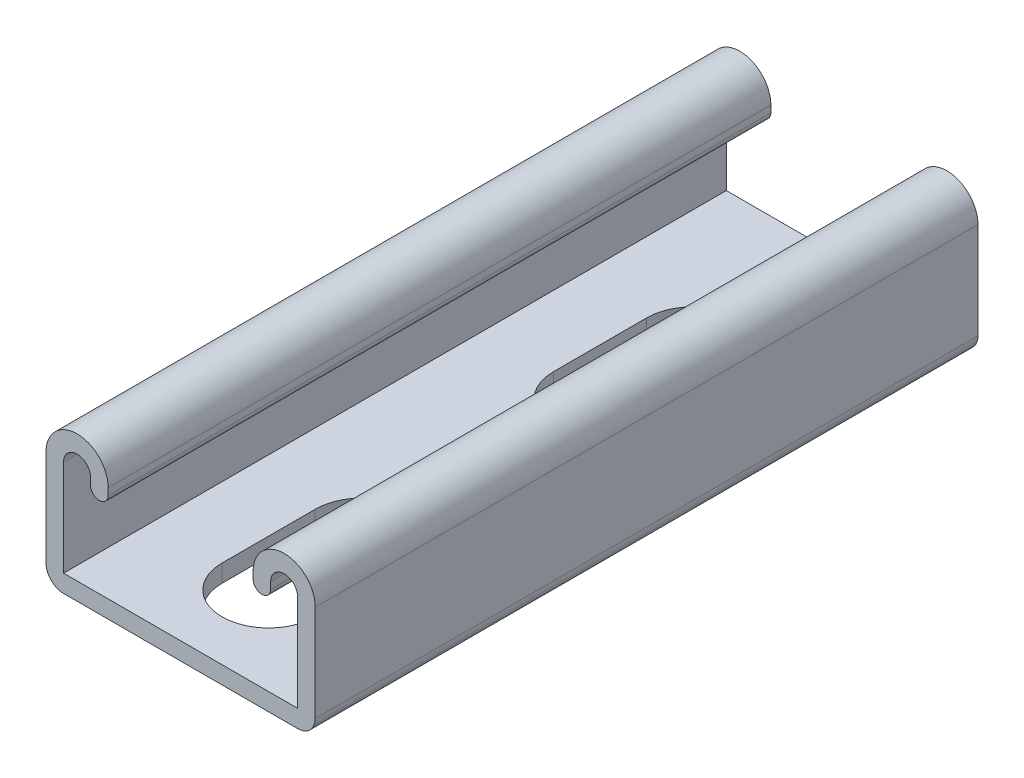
ISO-10303-21;
HEADER;
FILE_DESCRIPTION(('STEP AP214'),'2;1');
FILE_NAME('part.step','',(''),(''),'','','');
FILE_SCHEMA(('AUTOMOTIVE_DESIGN { 1 0 10303 214 1 1 1 1 }'));
ENDSEC;
DATA;
#1=APPLICATION_CONTEXT('core data for automotive mechanical design processes');
#2=APPLICATION_PROTOCOL_DEFINITION('international standard','automotive_design',2000,#1);
#3=PRODUCT_CONTEXT('',#1,'mechanical');
#4=PRODUCT('Part','Part','',(#3));
#5=PRODUCT_RELATED_PRODUCT_CATEGORY('part','',(#4));
#6=PRODUCT_DEFINITION_FORMATION('','',#4);
#7=PRODUCT_DEFINITION_CONTEXT('part definition',#1,'design');
#8=PRODUCT_DEFINITION('design','',#6,#7);
#9=PRODUCT_DEFINITION_SHAPE('','',#8);
#10=(LENGTH_UNIT() NAMED_UNIT(*) SI_UNIT(.MILLI.,.METRE.));
#11=(NAMED_UNIT(*) PLANE_ANGLE_UNIT() SI_UNIT($,.RADIAN.));
#12=(NAMED_UNIT(*) SI_UNIT($,.STERADIAN.) SOLID_ANGLE_UNIT());
#13=UNCERTAINTY_MEASURE_WITH_UNIT(LENGTH_MEASURE(1.E-05),#10,'distance_accuracy_value','');
#14=(GEOMETRIC_REPRESENTATION_CONTEXT(3) GLOBAL_UNCERTAINTY_ASSIGNED_CONTEXT((#13)) GLOBAL_UNIT_ASSIGNED_CONTEXT((#10,
#11,#12)) REPRESENTATION_CONTEXT('',''));
#15=CARTESIAN_POINT('',(0.,0.,0.));
#16=DIRECTION('',(0.,0.,1.));
#17=DIRECTION('',(1.,0.,0.));
#18=AXIS2_PLACEMENT_3D('',#15,#16,#17);
#19=CARTESIAN_POINT('',(-15.875,8.3693,101.6));
#20=DIRECTION('',(0.,0.,-1.));
#21=DIRECTION('',(-1.,0.,0.));
#22=AXIS2_PLACEMENT_3D('',#19,#20,#21);
#23=CYLINDRICAL_SURFACE('',#22,4.7625);
#24=CARTESIAN_POINT('',(-15.875,8.3693,0.));
#25=DIRECTION('',(0.,0.,1.));
#26=DIRECTION('',(-1.,0.,0.));
#27=AXIS2_PLACEMENT_3D('',#24,#25,#26);
#28=CIRCLE('',#27,4.7625);
#29=CARTESIAN_POINT('',(-11.1125,8.3693,0.));
#30=VERTEX_POINT('',#29);
#31=CARTESIAN_POINT('',(-20.6375,8.3693,0.));
#32=VERTEX_POINT('',#31);
#33=EDGE_CURVE('E254',#30,#32,#28,.T.);
#34=ORIENTED_EDGE('',*,*,#33,.T.);
#35=DIRECTION('',(0.,0.,-1.));
#36=VECTOR('',#35,1.);
#37=CARTESIAN_POINT('',(-20.6375,8.3693,101.6));
#38=LINE('',#37,#36);
#39=CARTESIAN_POINT('',(-20.6375,8.3693,101.6));
#40=VERTEX_POINT('',#39);
#41=EDGE_CURVE('E385',#40,#32,#38,.T.);
#42=ORIENTED_EDGE('',*,*,#41,.F.);
#43=CARTESIAN_POINT('',(-15.875,8.3693,101.6));
#44=DIRECTION('',(0.,0.,1.));
#45=DIRECTION('',(-1.,0.,0.));
#46=AXIS2_PLACEMENT_3D('',#43,#44,#45);
#47=CIRCLE('',#46,4.7625);
#48=CARTESIAN_POINT('',(-11.1125,8.3693,101.6));
#49=VERTEX_POINT('',#48);
#50=EDGE_CURVE('E261',#49,#40,#47,.T.);
#51=ORIENTED_EDGE('',*,*,#50,.F.);
#52=DIRECTION('',(0.,0.,-1.));
#53=VECTOR('',#52,1.);
#54=CARTESIAN_POINT('',(-11.1125,8.3693,101.6));
#55=LINE('',#54,#53);
#56=EDGE_CURVE('E299',#49,#30,#55,.T.);
#57=ORIENTED_EDGE('',*,*,#56,.T.);
#58=EDGE_LOOP('',(#34,#42,#51,#57));
#59=FACE_BOUND('',#58,.T.);
#60=ADVANCED_FACE('F33',(#59),#23,.T.);
#61=CARTESIAN_POINT('',(-20.6375,8.3693,101.6));
#62=DIRECTION('',(1.,0.,0.));
#63=DIRECTION('',(0.,1.,0.));
#64=AXIS2_PLACEMENT_3D('',#61,#62,#63);
#65=PLANE('',#64);
#66=DIRECTION('',(0.,-1.,0.));
#67=VECTOR('',#66,1.);
#68=CARTESIAN_POINT('',(-20.6375,8.3693,0.));
#69=LINE('',#68,#67);
#70=CARTESIAN_POINT('',(-20.6375,-6.4008,0.));
#71=VERTEX_POINT('',#70);
#72=EDGE_CURVE('E302',#32,#71,#69,.T.);
#73=ORIENTED_EDGE('',*,*,#72,.T.);
#74=DIRECTION('',(0.,0.,-1.));
#75=VECTOR('',#74,1.);
#76=CARTESIAN_POINT('',(-20.6375,-6.4008,101.6));
#77=LINE('',#76,#75);
#78=CARTESIAN_POINT('',(-20.6375,-6.4008,101.6));
#79=VERTEX_POINT('',#78);
#80=EDGE_CURVE('E382',#79,#71,#77,.T.);
#81=ORIENTED_EDGE('',*,*,#80,.F.);
#82=DIRECTION('',(0.,-1.,0.));
#83=VECTOR('',#82,1.);
#84=CARTESIAN_POINT('',(-20.6375,8.3693,101.6));
#85=LINE('',#84,#83);
#86=EDGE_CURVE('E264',#40,#79,#85,.T.);
#87=ORIENTED_EDGE('',*,*,#86,.F.);
#88=ORIENTED_EDGE('',*,*,#41,.T.);
#89=EDGE_LOOP('',(#73,#81,#87,#88));
#90=FACE_BOUND('',#89,.T.);
#91=ADVANCED_FACE('F426',(#90),#65,.F.);
#92=CARTESIAN_POINT('',(-17.9451,-6.4008,101.6));
#93=DIRECTION('',(0.,0.,-1.));
#94=DIRECTION('',(-1.,0.,0.));
#95=AXIS2_PLACEMENT_3D('',#92,#93,#94);
#96=CYLINDRICAL_SURFACE('',#95,2.6924);
#97=CARTESIAN_POINT('',(-17.9451,-6.4008,0.));
#98=DIRECTION('',(0.,0.,1.));
#99=DIRECTION('',(-1.,0.,0.));
#100=AXIS2_PLACEMENT_3D('',#97,#98,#99);
#101=CIRCLE('',#100,2.6924);
#102=CARTESIAN_POINT('',(-17.9451,-9.0932,0.));
#103=VERTEX_POINT('',#102);
#104=EDGE_CURVE('E304',#71,#103,#101,.T.);
#105=ORIENTED_EDGE('',*,*,#104,.T.);
#106=DIRECTION('',(0.,0.,-1.));
#107=VECTOR('',#106,1.);
#108=CARTESIAN_POINT('',(-17.9451,-9.0932,101.6));
#109=LINE('',#108,#107);
#110=CARTESIAN_POINT('',(-17.9451,-9.0932,101.6));
#111=VERTEX_POINT('',#110);
#112=EDGE_CURVE('E379',#111,#103,#109,.T.);
#113=ORIENTED_EDGE('',*,*,#112,.F.);
#114=CARTESIAN_POINT('',(-17.9451,-6.4008,101.6));
#115=DIRECTION('',(0.,0.,1.));
#116=DIRECTION('',(-1.,0.,0.));
#117=AXIS2_PLACEMENT_3D('',#114,#115,#116);
#118=CIRCLE('',#117,2.6924);
#119=EDGE_CURVE('E267',#79,#111,#118,.T.);
#120=ORIENTED_EDGE('',*,*,#119,.F.);
#121=ORIENTED_EDGE('',*,*,#80,.T.);
#122=EDGE_LOOP('',(#105,#113,#120,#121));
#123=FACE_BOUND('',#122,.T.);
#124=ADVANCED_FACE('F431',(#123),#96,.T.);
#125=CARTESIAN_POINT('',(-17.9451,-9.0932,101.6));
#126=DIRECTION('',(0.,1.,0.));
#127=DIRECTION('',(0.,0.,1.));
#128=AXIS2_PLACEMENT_3D('',#125,#126,#127);
#129=PLANE('',#128);
#130=DIRECTION('',(0.,0.,-1.));
#131=VECTOR('',#130,1.);
#132=CARTESIAN_POINT('',(-7.14375,-9.09319999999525,73.81875));
#133=LINE('',#132,#131);
#134=CARTESIAN_POINT('',(-7.14375,-9.0932,88.10625));
#135=VERTEX_POINT('',#134);
#136=CARTESIAN_POINT('',(-7.14375,-9.09319999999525,73.81875));
#137=VERTEX_POINT('',#136);
#138=EDGE_CURVE('E207',#135,#137,#133,.T.);
#139=ORIENTED_EDGE('',*,*,#138,.F.);
#140=CARTESIAN_POINT('',(0.,-9.09319999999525,88.10625));
#141=DIRECTION('',(0.,-1.,0.));
#142=DIRECTION('',(0.,0.,-1.));
#143=AXIS2_PLACEMENT_3D('',#140,#141,#142);
#144=CIRCLE('',#143,7.14375);
#145=CARTESIAN_POINT('',(7.14375,-9.09319999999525,88.10625));
#146=VERTEX_POINT('',#145);
#147=EDGE_CURVE('E47',#146,#135,#144,.T.);
#148=ORIENTED_EDGE('',*,*,#147,.F.);
#149=DIRECTION('',(0.,0.,1.));
#150=VECTOR('',#149,1.);
#151=CARTESIAN_POINT('',(7.14375,-9.09319999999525,88.10625));
#152=LINE('',#151,#150);
#153=CARTESIAN_POINT('',(7.14375,-9.09319999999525,73.81875));
#154=VERTEX_POINT('',#153);
#155=EDGE_CURVE('E223',#154,#146,#152,.T.);
#156=ORIENTED_EDGE('',*,*,#155,.F.);
#157=CARTESIAN_POINT('',(0.,-9.09319999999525,73.81875));
#158=DIRECTION('',(0.,-1.,0.));
#159=DIRECTION('',(0.,0.,-1.));
#160=AXIS2_PLACEMENT_3D('',#157,#158,#159);
#161=CIRCLE('',#160,7.14375);
#162=EDGE_CURVE('E217',#137,#154,#161,.T.);
#163=ORIENTED_EDGE('',*,*,#162,.F.);
#164=EDGE_LOOP('',(#139,#148,#156,#163));
#165=FACE_BOUND('',#164,.T.);
#166=DIRECTION('',(0.,0.,-1.));
#167=VECTOR('',#166,1.);
#168=CARTESIAN_POINT('',(-7.14375,-9.09319999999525,23.01875));
#169=LINE('',#168,#167);
#170=CARTESIAN_POINT('',(-7.14375,-9.0932,37.30625));
#171=VERTEX_POINT('',#170);
#172=CARTESIAN_POINT('',(-7.14375,-9.09319999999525,23.01875));
#173=VERTEX_POINT('',#172);
#174=EDGE_CURVE('E242',#171,#173,#169,.T.);
#175=ORIENTED_EDGE('',*,*,#174,.F.);
#176=CARTESIAN_POINT('',(0.,-9.09319999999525,37.30625));
#177=DIRECTION('',(0.,-1.,0.));
#178=DIRECTION('',(0.,0.,-1.));
#179=AXIS2_PLACEMENT_3D('',#176,#177,#178);
#180=CIRCLE('',#179,7.14375);
#181=CARTESIAN_POINT('',(7.14375,-9.09319999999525,37.30625));
#182=VERTEX_POINT('',#181);
#183=EDGE_CURVE('E240',#182,#171,#180,.T.);
#184=ORIENTED_EDGE('',*,*,#183,.F.);
#185=DIRECTION('',(0.,0.,1.));
#186=VECTOR('',#185,1.);
#187=CARTESIAN_POINT('',(7.14375,-9.09319999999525,37.30625));
#188=LINE('',#187,#186);
#189=CARTESIAN_POINT('',(7.14375,-9.09319999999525,23.01875));
#190=VERTEX_POINT('',#189);
#191=EDGE_CURVE('E248',#190,#182,#188,.T.);
#192=ORIENTED_EDGE('',*,*,#191,.F.);
#193=CARTESIAN_POINT('',(0.,-9.09319999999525,23.01875));
#194=DIRECTION('',(0.,-1.,0.));
#195=DIRECTION('',(0.,0.,-1.));
#196=AXIS2_PLACEMENT_3D('',#193,#194,#195);
#197=CIRCLE('',#196,7.14375);
#198=EDGE_CURVE('E245',#173,#190,#197,.T.);
#199=ORIENTED_EDGE('',*,*,#198,.F.);
#200=EDGE_LOOP('',(#175,#184,#192,#199));
#201=FACE_BOUND('',#200,.T.);
#202=DIRECTION('',(1.,0.,0.));
#203=VECTOR('',#202,1.);
#204=CARTESIAN_POINT('',(-17.9451,-9.0932,0.));
#205=LINE('',#204,#203);
#206=CARTESIAN_POINT('',(17.9451,-9.0932,0.));
#207=VERTEX_POINT('',#206);
#208=EDGE_CURVE('E306',#103,#207,#205,.T.);
#209=ORIENTED_EDGE('',*,*,#208,.T.);
#210=DIRECTION('',(0.,0.,-1.));
#211=VECTOR('',#210,1.);
#212=CARTESIAN_POINT('',(17.9451,-9.0932,101.6));
#213=LINE('',#212,#211);
#214=CARTESIAN_POINT('',(17.9451,-9.0932,101.6));
#215=VERTEX_POINT('',#214);
#216=EDGE_CURVE('E376',#215,#207,#213,.T.);
#217=ORIENTED_EDGE('',*,*,#216,.F.);
#218=DIRECTION('',(1.,0.,0.));
#219=VECTOR('',#218,1.);
#220=CARTESIAN_POINT('',(-17.9451,-9.0932,101.6));
#221=LINE('',#220,#219);
#222=EDGE_CURVE('E269',#111,#215,#221,.T.);
#223=ORIENTED_EDGE('',*,*,#222,.F.);
#224=ORIENTED_EDGE('',*,*,#112,.T.);
#225=EDGE_LOOP('',(#209,#217,#223,#224));
#226=FACE_BOUND('',#225,.T.);
#227=ADVANCED_FACE('F221',(#165,#201,#226),#129,.F.);
#228=CARTESIAN_POINT('',(17.9451,-6.4008,101.6));
#229=DIRECTION('',(0.,0.,-1.));
#230=DIRECTION('',(-1.,0.,0.));
#231=AXIS2_PLACEMENT_3D('',#228,#229,#230);
#232=CYLINDRICAL_SURFACE('',#231,2.6924);
#233=CARTESIAN_POINT('',(17.9451,-6.4008,0.));
#234=DIRECTION('',(0.,0.,1.));
#235=DIRECTION('',(1.,0.,0.));
#236=AXIS2_PLACEMENT_3D('',#233,#234,#235);
#237=CIRCLE('',#236,2.6924);
#238=CARTESIAN_POINT('',(20.6375,-6.4008,0.));
#239=VERTEX_POINT('',#238);
#240=EDGE_CURVE('E308',#207,#239,#237,.T.);
#241=ORIENTED_EDGE('',*,*,#240,.T.);
#242=DIRECTION('',(0.,0.,-1.));
#243=VECTOR('',#242,1.);
#244=CARTESIAN_POINT('',(20.6375,-6.4008,101.6));
#245=LINE('',#244,#243);
#246=CARTESIAN_POINT('',(20.6375,-6.4008,101.6));
#247=VERTEX_POINT('',#246);
#248=EDGE_CURVE('E373',#247,#239,#245,.T.);
#249=ORIENTED_EDGE('',*,*,#248,.F.);
#250=CARTESIAN_POINT('',(17.9451,-6.4008,101.6));
#251=DIRECTION('',(0.,0.,1.));
#252=DIRECTION('',(1.,0.,0.));
#253=AXIS2_PLACEMENT_3D('',#250,#251,#252);
#254=CIRCLE('',#253,2.6924);
#255=EDGE_CURVE('E271',#215,#247,#254,.T.);
#256=ORIENTED_EDGE('',*,*,#255,.F.);
#257=ORIENTED_EDGE('',*,*,#216,.T.);
#258=EDGE_LOOP('',(#241,#249,#256,#257));
#259=FACE_BOUND('',#258,.T.);
#260=ADVANCED_FACE('F511',(#259),#232,.T.);
#261=CARTESIAN_POINT('',(20.6375,-6.4008,101.6));
#262=DIRECTION('',(-1.,0.,0.));
#263=DIRECTION('',(0.,-1.,0.));
#264=AXIS2_PLACEMENT_3D('',#261,#262,#263);
#265=PLANE('',#264);
#266=DIRECTION('',(0.,1.,0.));
#267=VECTOR('',#266,1.);
#268=CARTESIAN_POINT('',(20.6375,-6.4008,0.));
#269=LINE('',#268,#267);
#270=CARTESIAN_POINT('',(20.6375,8.3693,0.));
#271=VERTEX_POINT('',#270);
#272=EDGE_CURVE('E310',#239,#271,#269,.T.);
#273=ORIENTED_EDGE('',*,*,#272,.T.);
#274=DIRECTION('',(0.,0.,-1.));
#275=VECTOR('',#274,1.);
#276=CARTESIAN_POINT('',(20.6375,8.3693,101.6));
#277=LINE('',#276,#275);
#278=CARTESIAN_POINT('',(20.6375,8.3693,101.6));
#279=VERTEX_POINT('',#278);
#280=EDGE_CURVE('E370',#279,#271,#277,.T.);
#281=ORIENTED_EDGE('',*,*,#280,.F.);
#282=DIRECTION('',(0.,1.,0.));
#283=VECTOR('',#282,1.);
#284=CARTESIAN_POINT('',(20.6375,-6.4008,101.6));
#285=LINE('',#284,#283);
#286=EDGE_CURVE('E273',#247,#279,#285,.T.);
#287=ORIENTED_EDGE('',*,*,#286,.F.);
#288=ORIENTED_EDGE('',*,*,#248,.T.);
#289=EDGE_LOOP('',(#273,#281,#287,#288));
#290=FACE_BOUND('',#289,.T.);
#291=ADVANCED_FACE('F507',(#290),#265,.F.);
#292=CARTESIAN_POINT('',(15.875,8.3693,101.6));
#293=DIRECTION('',(0.,0.,-1.));
#294=DIRECTION('',(-1.,0.,0.));
#295=AXIS2_PLACEMENT_3D('',#292,#293,#294);
#296=CYLINDRICAL_SURFACE('',#295,4.7625);
#297=CARTESIAN_POINT('',(15.875,8.3693,0.));
#298=DIRECTION('',(0.,0.,1.));
#299=DIRECTION('',(1.,0.,0.));
#300=AXIS2_PLACEMENT_3D('',#297,#298,#299);
#301=CIRCLE('',#300,4.7625);
#302=CARTESIAN_POINT('',(11.1125,8.3693,0.));
#303=VERTEX_POINT('',#302);
#304=EDGE_CURVE('E312',#271,#303,#301,.T.);
#305=ORIENTED_EDGE('',*,*,#304,.T.);
#306=DIRECTION('',(0.,0.,-1.));
#307=VECTOR('',#306,1.);
#308=CARTESIAN_POINT('',(11.1125,8.3693,101.6));
#309=LINE('',#308,#307);
#310=CARTESIAN_POINT('',(11.1125,8.3693,101.6));
#311=VERTEX_POINT('',#310);
#312=EDGE_CURVE('E367',#311,#303,#309,.T.);
#313=ORIENTED_EDGE('',*,*,#312,.F.);
#314=CARTESIAN_POINT('',(15.875,8.3693,101.6));
#315=DIRECTION('',(0.,0.,1.));
#316=DIRECTION('',(1.,0.,0.));
#317=AXIS2_PLACEMENT_3D('',#314,#315,#316);
#318=CIRCLE('',#317,4.7625);
#319=EDGE_CURVE('E275',#279,#311,#318,.T.);
#320=ORIENTED_EDGE('',*,*,#319,.F.);
#321=ORIENTED_EDGE('',*,*,#280,.T.);
#322=EDGE_LOOP('',(#305,#313,#320,#321));
#323=FACE_BOUND('',#322,.T.);
#324=ADVANCED_FACE('F502',(#323),#296,.T.);
#325=CARTESIAN_POINT('',(11.1125,8.3693,101.6));
#326=DIRECTION('',(1.,0.,0.));
#327=DIRECTION('',(0.,0.,-1.));
#328=AXIS2_PLACEMENT_3D('',#325,#326,#327);
#329=PLANE('',#328);
#330=DIRECTION('',(0.,-1.,0.));
#331=VECTOR('',#330,1.);
#332=CARTESIAN_POINT('',(11.1125,8.3693,0.));
#333=LINE('',#332,#331);
#334=CARTESIAN_POINT('',(11.1125,7.33425,0.));
#335=VERTEX_POINT('',#334);
#336=EDGE_CURVE('E314',#303,#335,#333,.T.);
#337=ORIENTED_EDGE('',*,*,#336,.T.);
#338=DIRECTION('',(0.,0.,-1.));
#339=VECTOR('',#338,1.);
#340=CARTESIAN_POINT('',(11.1125,7.33425,101.6));
#341=LINE('',#340,#339);
#342=CARTESIAN_POINT('',(11.1125,7.33425,101.6));
#343=VERTEX_POINT('',#342);
#344=EDGE_CURVE('E364',#343,#335,#341,.T.);
#345=ORIENTED_EDGE('',*,*,#344,.F.);
#346=DIRECTION('',(0.,-1.,0.));
#347=VECTOR('',#346,1.);
#348=CARTESIAN_POINT('',(11.1125,8.3693,101.6));
#349=LINE('',#348,#347);
#350=EDGE_CURVE('E277',#311,#343,#349,.T.);
#351=ORIENTED_EDGE('',*,*,#350,.F.);
#352=ORIENTED_EDGE('',*,*,#312,.T.);
#353=EDGE_LOOP('',(#337,#345,#351,#352));
#354=FACE_BOUND('',#353,.T.);
#355=ADVANCED_FACE('F496',(#354),#329,.F.);
#356=CARTESIAN_POINT('',(12.4587,7.33425,101.6));
#357=DIRECTION('',(0.,0.,-1.));
#358=DIRECTION('',(-1.,0.,0.));
#359=AXIS2_PLACEMENT_3D('',#356,#357,#358);
#360=CYLINDRICAL_SURFACE('',#359,1.3462);
#361=CARTESIAN_POINT('',(12.4587,7.33425,0.));
#362=DIRECTION('',(0.,0.,1.));
#363=DIRECTION('',(1.,0.,0.));
#364=AXIS2_PLACEMENT_3D('',#361,#362,#363);
#365=CIRCLE('',#364,1.3462);
#366=CARTESIAN_POINT('',(13.8049,7.33425,0.));
#367=VERTEX_POINT('',#366);
#368=EDGE_CURVE('E316',#335,#367,#365,.T.);
#369=ORIENTED_EDGE('',*,*,#368,.T.);
#370=DIRECTION('',(0.,0.,-1.));
#371=VECTOR('',#370,1.);
#372=CARTESIAN_POINT('',(13.8049,7.33425,101.6));
#373=LINE('',#372,#371);
#374=CARTESIAN_POINT('',(13.8049,7.33425,101.6));
#375=VERTEX_POINT('',#374);
#376=EDGE_CURVE('E361',#375,#367,#373,.T.);
#377=ORIENTED_EDGE('',*,*,#376,.F.);
#378=CARTESIAN_POINT('',(12.4587,7.33425,101.6));
#379=DIRECTION('',(0.,0.,1.));
#380=DIRECTION('',(1.,0.,0.));
#381=AXIS2_PLACEMENT_3D('',#378,#379,#380);
#382=CIRCLE('',#381,1.3462);
#383=EDGE_CURVE('E279',#343,#375,#382,.T.);
#384=ORIENTED_EDGE('',*,*,#383,.F.);
#385=ORIENTED_EDGE('',*,*,#344,.T.);
#386=EDGE_LOOP('',(#369,#377,#384,#385));
#387=FACE_BOUND('',#386,.T.);
#388=ADVANCED_FACE('F492',(#387),#360,.T.);
#389=CARTESIAN_POINT('',(13.8049,8.3693,101.6));
#390=DIRECTION('',(-1.,0.,0.));
#391=DIRECTION('',(0.,0.,1.));
#392=AXIS2_PLACEMENT_3D('',#389,#390,#391);
#393=PLANE('',#392);
#394=DIRECTION('',(0.,1.,0.));
#395=VECTOR('',#394,1.);
#396=CARTESIAN_POINT('',(13.8049,8.3693,0.));
#397=LINE('',#396,#395);
#398=CARTESIAN_POINT('',(13.8049,8.3693,0.));
#399=VERTEX_POINT('',#398);
#400=EDGE_CURVE('E318',#367,#399,#397,.T.);
#401=ORIENTED_EDGE('',*,*,#400,.T.);
#402=DIRECTION('',(0.,0.,-1.));
#403=VECTOR('',#402,1.);
#404=CARTESIAN_POINT('',(13.8049,8.3693,101.6));
#405=LINE('',#404,#403);
#406=CARTESIAN_POINT('',(13.8049,8.3693,101.6));
#407=VERTEX_POINT('',#406);
#408=EDGE_CURVE('E358',#407,#399,#405,.T.);
#409=ORIENTED_EDGE('',*,*,#408,.F.);
#410=DIRECTION('',(0.,1.,0.));
#411=VECTOR('',#410,1.);
#412=CARTESIAN_POINT('',(13.8049,8.3693,101.6));
#413=LINE('',#412,#411);
#414=EDGE_CURVE('E281',#375,#407,#413,.T.);
#415=ORIENTED_EDGE('',*,*,#414,.F.);
#416=ORIENTED_EDGE('',*,*,#376,.T.);
#417=EDGE_LOOP('',(#401,#409,#415,#416));
#418=FACE_BOUND('',#417,.T.);
#419=ADVANCED_FACE('F487',(#418),#393,.F.);
#420=CARTESIAN_POINT('',(15.875,8.3693,101.6));
#421=DIRECTION('',(0.,0.,-1.));
#422=DIRECTION('',(-1.,0.,0.));
#423=AXIS2_PLACEMENT_3D('',#420,#421,#422);
#424=CYLINDRICAL_SURFACE('',#423,2.0701);
#425=CARTESIAN_POINT('',(15.875,8.3693,0.));
#426=DIRECTION('',(0.,0.,-1.));
#427=DIRECTION('',(1.,0.,0.));
#428=AXIS2_PLACEMENT_3D('',#425,#426,#427);
#429=CIRCLE('',#428,2.0701);
#430=CARTESIAN_POINT('',(17.9451,8.3693,0.));
#431=VERTEX_POINT('',#430);
#432=EDGE_CURVE('E320',#399,#431,#429,.T.);
#433=ORIENTED_EDGE('',*,*,#432,.T.);
#434=DIRECTION('',(0.,0.,-1.));
#435=VECTOR('',#434,1.);
#436=CARTESIAN_POINT('',(17.9451,8.3693,101.6));
#437=LINE('',#436,#435);
#438=CARTESIAN_POINT('',(17.9451,8.3693,101.6));
#439=VERTEX_POINT('',#438);
#440=EDGE_CURVE('E355',#439,#431,#437,.T.);
#441=ORIENTED_EDGE('',*,*,#440,.F.);
#442=CARTESIAN_POINT('',(15.875,8.3693,101.6));
#443=DIRECTION('',(0.,0.,-1.));
#444=DIRECTION('',(1.,0.,0.));
#445=AXIS2_PLACEMENT_3D('',#442,#443,#444);
#446=CIRCLE('',#445,2.0701);
#447=EDGE_CURVE('E283',#407,#439,#446,.T.);
#448=ORIENTED_EDGE('',*,*,#447,.F.);
#449=ORIENTED_EDGE('',*,*,#408,.T.);
#450=EDGE_LOOP('',(#433,#441,#448,#449));
#451=FACE_BOUND('',#450,.T.);
#452=ADVANCED_FACE('F481',(#451),#424,.F.);
#453=CARTESIAN_POINT('',(17.9451,-6.4008,101.6));
#454=DIRECTION('',(1.,0.,0.));
#455=DIRECTION('',(0.,1.,0.));
#456=AXIS2_PLACEMENT_3D('',#453,#454,#455);
#457=PLANE('',#456);
#458=DIRECTION('',(0.,-1.,0.));
#459=VECTOR('',#458,1.);
#460=CARTESIAN_POINT('',(17.9451,-6.4008,0.));
#461=LINE('',#460,#459);
#462=CARTESIAN_POINT('',(17.9451,-6.4008,0.));
#463=VERTEX_POINT('',#462);
#464=EDGE_CURVE('E322',#431,#463,#461,.T.);
#465=ORIENTED_EDGE('',*,*,#464,.T.);
#466=DIRECTION('',(0.,0.,-1.));
#467=VECTOR('',#466,1.);
#468=CARTESIAN_POINT('',(17.9451,-6.4008,101.6));
#469=LINE('',#468,#467);
#470=CARTESIAN_POINT('',(17.9451,-6.4008,101.6));
#471=VERTEX_POINT('',#470);
#472=EDGE_CURVE('E352',#471,#463,#469,.T.);
#473=ORIENTED_EDGE('',*,*,#472,.F.);
#474=DIRECTION('',(0.,-1.,0.));
#475=VECTOR('',#474,1.);
#476=CARTESIAN_POINT('',(17.9451,-6.4008,101.6));
#477=LINE('',#476,#475);
#478=EDGE_CURVE('E285',#439,#471,#477,.T.);
#479=ORIENTED_EDGE('',*,*,#478,.F.);
#480=ORIENTED_EDGE('',*,*,#440,.T.);
#481=EDGE_LOOP('',(#465,#473,#479,#480));
#482=FACE_BOUND('',#481,.T.);
#483=ADVANCED_FACE('F477',(#482),#457,.F.);
#484=CARTESIAN_POINT('',(-17.9451,-6.4008,101.6));
#485=DIRECTION('',(0.,-1.,0.));
#486=DIRECTION('',(0.,0.,-1.));
#487=AXIS2_PLACEMENT_3D('',#484,#485,#486);
#488=PLANE('',#487);
#489=DIRECTION('',(0.,0.,1.));
#490=VECTOR('',#489,1.);
#491=CARTESIAN_POINT('',(7.14374999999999,-6.4008,152.4));
#492=LINE('',#491,#490);
#493=CARTESIAN_POINT('',(7.14375,-6.4008,73.81875));
#494=VERTEX_POINT('',#493);
#495=CARTESIAN_POINT('',(7.14375,-6.4008,88.10625));
#496=VERTEX_POINT('',#495);
#497=EDGE_CURVE('E233',#494,#496,#492,.T.);
#498=ORIENTED_EDGE('',*,*,#497,.T.);
#499=CARTESIAN_POINT('',(0.,-6.4008,88.10625));
#500=DIRECTION('',(0.,-1.,0.));
#501=DIRECTION('',(0.,0.,-1.));
#502=AXIS2_PLACEMENT_3D('',#499,#500,#501);
#503=CIRCLE('',#502,7.14375);
#504=CARTESIAN_POINT('',(-7.14375,-6.4008,88.10625));
#505=VERTEX_POINT('',#504);
#506=EDGE_CURVE('E237',#496,#505,#503,.T.);
#507=ORIENTED_EDGE('',*,*,#506,.T.);
#508=DIRECTION('',(0.,0.,-1.));
#509=VECTOR('',#508,1.);
#510=CARTESIAN_POINT('',(-7.14375,-6.4008,152.4));
#511=LINE('',#510,#509);
#512=CARTESIAN_POINT('',(-7.14375,-6.4008,73.81875));
#513=VERTEX_POINT('',#512);
#514=EDGE_CURVE('E214',#505,#513,#511,.T.);
#515=ORIENTED_EDGE('',*,*,#514,.T.);
#516=CARTESIAN_POINT('',(0.,-6.4008,73.81875));
#517=DIRECTION('',(0.,-1.,0.));
#518=DIRECTION('',(0.,0.,-1.));
#519=AXIS2_PLACEMENT_3D('',#516,#517,#518);
#520=CIRCLE('',#519,7.14375);
#521=EDGE_CURVE('E55',#513,#494,#520,.T.);
#522=ORIENTED_EDGE('',*,*,#521,.T.);
#523=EDGE_LOOP('',(#498,#507,#515,#522));
#524=FACE_BOUND('',#523,.T.);
#525=DIRECTION('',(0.,0.,1.));
#526=VECTOR('',#525,1.);
#527=CARTESIAN_POINT('',(7.14374999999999,-6.4008,101.6));
#528=LINE('',#527,#526);
#529=CARTESIAN_POINT('',(7.14375,-6.4008,23.01875));
#530=VERTEX_POINT('',#529);
#531=CARTESIAN_POINT('',(7.14375,-6.4008,37.30625));
#532=VERTEX_POINT('',#531);
#533=EDGE_CURVE('E40',#530,#532,#528,.T.);
#534=ORIENTED_EDGE('',*,*,#533,.T.);
#535=CARTESIAN_POINT('',(0.,-6.4008,37.30625));
#536=DIRECTION('',(0.,-1.,0.));
#537=DIRECTION('',(0.,0.,-1.));
#538=AXIS2_PLACEMENT_3D('',#535,#536,#537);
#539=CIRCLE('',#538,7.14375);
#540=CARTESIAN_POINT('',(-7.14375,-6.4008,37.30625));
#541=VERTEX_POINT('',#540);
#542=EDGE_CURVE('E11',#532,#541,#539,.T.);
#543=ORIENTED_EDGE('',*,*,#542,.T.);
#544=DIRECTION('',(0.,0.,-1.));
#545=VECTOR('',#544,1.);
#546=CARTESIAN_POINT('',(-7.14375,-6.4008,101.6));
#547=LINE('',#546,#545);
#548=CARTESIAN_POINT('',(-7.14375,-6.4008,23.01875));
#549=VERTEX_POINT('',#548);
#550=EDGE_CURVE('E388',#541,#549,#547,.T.);
#551=ORIENTED_EDGE('',*,*,#550,.T.);
#552=CARTESIAN_POINT('',(0.,-6.4008,23.01875));
#553=DIRECTION('',(0.,-1.,0.));
#554=DIRECTION('',(0.,0.,-1.));
#555=AXIS2_PLACEMENT_3D('',#552,#553,#554);
#556=CIRCLE('',#555,7.14375);
#557=EDGE_CURVE('E391',#549,#530,#556,.T.);
#558=ORIENTED_EDGE('',*,*,#557,.T.);
#559=EDGE_LOOP('',(#534,#543,#551,#558));
#560=FACE_BOUND('',#559,.T.);
#561=DIRECTION('',(-1.,0.,0.));
#562=VECTOR('',#561,1.);
#563=CARTESIAN_POINT('',(-17.9451,-6.4008,0.));
#564=LINE('',#563,#562);
#565=CARTESIAN_POINT('',(-17.9451,-6.4008,0.));
#566=VERTEX_POINT('',#565);
#567=EDGE_CURVE('E324',#463,#566,#564,.T.);
#568=ORIENTED_EDGE('',*,*,#567,.T.);
#569=DIRECTION('',(0.,0.,-1.));
#570=VECTOR('',#569,1.);
#571=CARTESIAN_POINT('',(-17.9451,-6.4008,101.6));
#572=LINE('',#571,#570);
#573=CARTESIAN_POINT('',(-17.9451,-6.4008,101.6));
#574=VERTEX_POINT('',#573);
#575=EDGE_CURVE('E349',#574,#566,#572,.T.);
#576=ORIENTED_EDGE('',*,*,#575,.F.);
#577=DIRECTION('',(-1.,0.,0.));
#578=VECTOR('',#577,1.);
#579=CARTESIAN_POINT('',(-17.9451,-6.4008,101.6));
#580=LINE('',#579,#578);
#581=EDGE_CURVE('E287',#471,#574,#580,.T.);
#582=ORIENTED_EDGE('',*,*,#581,.F.);
#583=ORIENTED_EDGE('',*,*,#472,.T.);
#584=EDGE_LOOP('',(#568,#576,#582,#583));
#585=FACE_BOUND('',#584,.T.);
#586=ADVANCED_FACE('F395',(#524,#560,#585),#488,.F.);
#587=CARTESIAN_POINT('',(-17.9451,8.3693,101.6));
#588=DIRECTION('',(-1.,0.,0.));
#589=DIRECTION('',(0.,-1.,0.));
#590=AXIS2_PLACEMENT_3D('',#587,#588,#589);
#591=PLANE('',#590);
#592=DIRECTION('',(0.,1.,0.));
#593=VECTOR('',#592,1.);
#594=CARTESIAN_POINT('',(-17.9451,8.3693,0.));
#595=LINE('',#594,#593);
#596=CARTESIAN_POINT('',(-17.9451,8.3693,0.));
#597=VERTEX_POINT('',#596);
#598=EDGE_CURVE('E326',#566,#597,#595,.T.);
#599=ORIENTED_EDGE('',*,*,#598,.T.);
#600=DIRECTION('',(0.,0.,-1.));
#601=VECTOR('',#600,1.);
#602=CARTESIAN_POINT('',(-17.9451,8.3693,101.6));
#603=LINE('',#602,#601);
#604=CARTESIAN_POINT('',(-17.9451,8.3693,101.6));
#605=VERTEX_POINT('',#604);
#606=EDGE_CURVE('E346',#605,#597,#603,.T.);
#607=ORIENTED_EDGE('',*,*,#606,.F.);
#608=DIRECTION('',(0.,1.,0.));
#609=VECTOR('',#608,1.);
#610=CARTESIAN_POINT('',(-17.9451,8.3693,101.6));
#611=LINE('',#610,#609);
#612=EDGE_CURVE('E289',#574,#605,#611,.T.);
#613=ORIENTED_EDGE('',*,*,#612,.F.);
#614=ORIENTED_EDGE('',*,*,#575,.T.);
#615=EDGE_LOOP('',(#599,#607,#613,#614));
#616=FACE_BOUND('',#615,.T.);
#617=ADVANCED_FACE('F468',(#616),#591,.F.);
#618=CARTESIAN_POINT('',(-15.875,8.3693,101.6));
#619=DIRECTION('',(0.,0.,-1.));
#620=DIRECTION('',(-1.,0.,0.));
#621=AXIS2_PLACEMENT_3D('',#618,#619,#620);
#622=CYLINDRICAL_SURFACE('',#621,2.0701);
#623=CARTESIAN_POINT('',(-15.875,8.3693,0.));
#624=DIRECTION('',(0.,0.,-1.));
#625=DIRECTION('',(-1.,0.,0.));
#626=AXIS2_PLACEMENT_3D('',#623,#624,#625);
#627=CIRCLE('',#626,2.0701);
#628=CARTESIAN_POINT('',(-13.8049,8.3693,0.));
#629=VERTEX_POINT('',#628);
#630=EDGE_CURVE('E328',#597,#629,#627,.T.);
#631=ORIENTED_EDGE('',*,*,#630,.T.);
#632=DIRECTION('',(0.,0.,-1.));
#633=VECTOR('',#632,1.);
#634=CARTESIAN_POINT('',(-13.8049,8.3693,101.6));
#635=LINE('',#634,#633);
#636=CARTESIAN_POINT('',(-13.8049,8.3693,101.6));
#637=VERTEX_POINT('',#636);
#638=EDGE_CURVE('E343',#637,#629,#635,.T.);
#639=ORIENTED_EDGE('',*,*,#638,.F.);
#640=CARTESIAN_POINT('',(-15.875,8.3693,101.6));
#641=DIRECTION('',(0.,0.,-1.));
#642=DIRECTION('',(-1.,0.,0.));
#643=AXIS2_PLACEMENT_3D('',#640,#641,#642);
#644=CIRCLE('',#643,2.0701);
#645=EDGE_CURVE('E291',#605,#637,#644,.T.);
#646=ORIENTED_EDGE('',*,*,#645,.F.);
#647=ORIENTED_EDGE('',*,*,#606,.T.);
#648=EDGE_LOOP('',(#631,#639,#646,#647));
#649=FACE_BOUND('',#648,.T.);
#650=ADVANCED_FACE('F464',(#649),#622,.F.);
#651=CARTESIAN_POINT('',(-13.8049,8.3693,101.6));
#652=DIRECTION('',(1.,0.,0.));
#653=DIRECTION('',(0.,1.,0.));
#654=AXIS2_PLACEMENT_3D('',#651,#652,#653);
#655=PLANE('',#654);
#656=DIRECTION('',(0.,-1.,0.));
#657=VECTOR('',#656,1.);
#658=CARTESIAN_POINT('',(-13.8049,8.3693,0.));
#659=LINE('',#658,#657);
#660=CARTESIAN_POINT('',(-13.8049,7.33425,0.));
#661=VERTEX_POINT('',#660);
#662=EDGE_CURVE('E330',#629,#661,#659,.T.);
#663=ORIENTED_EDGE('',*,*,#662,.T.);
#664=DIRECTION('',(0.,0.,-1.));
#665=VECTOR('',#664,1.);
#666=CARTESIAN_POINT('',(-13.8049,7.33425,101.6));
#667=LINE('',#666,#665);
#668=CARTESIAN_POINT('',(-13.8049,7.33425,101.6));
#669=VERTEX_POINT('',#668);
#670=EDGE_CURVE('E340',#669,#661,#667,.T.);
#671=ORIENTED_EDGE('',*,*,#670,.F.);
#672=DIRECTION('',(0.,-1.,0.));
#673=VECTOR('',#672,1.);
#674=CARTESIAN_POINT('',(-13.8049,8.3693,101.6));
#675=LINE('',#674,#673);
#676=EDGE_CURVE('E293',#637,#669,#675,.T.);
#677=ORIENTED_EDGE('',*,*,#676,.F.);
#678=ORIENTED_EDGE('',*,*,#638,.T.);
#679=EDGE_LOOP('',(#663,#671,#677,#678));
#680=FACE_BOUND('',#679,.T.);
#681=ADVANCED_FACE('F459',(#680),#655,.F.);
#682=CARTESIAN_POINT('',(-12.4587,7.33425,101.6));
#683=DIRECTION('',(0.,0.,-1.));
#684=DIRECTION('',(-1.,0.,0.));
#685=AXIS2_PLACEMENT_3D('',#682,#683,#684);
#686=CYLINDRICAL_SURFACE('',#685,1.3462);
#687=CARTESIAN_POINT('',(-12.4587,7.33425,0.));
#688=DIRECTION('',(0.,0.,1.));
#689=DIRECTION('',(-1.,0.,0.));
#690=AXIS2_PLACEMENT_3D('',#687,#688,#689);
#691=CIRCLE('',#690,1.3462);
#692=CARTESIAN_POINT('',(-11.1125,7.33425,0.));
#693=VERTEX_POINT('',#692);
#694=EDGE_CURVE('E332',#661,#693,#691,.T.);
#695=ORIENTED_EDGE('',*,*,#694,.T.);
#696=DIRECTION('',(0.,0.,-1.));
#697=VECTOR('',#696,1.);
#698=CARTESIAN_POINT('',(-11.1125,7.33425,101.6));
#699=LINE('',#698,#697);
#700=CARTESIAN_POINT('',(-11.1125,7.33425,101.6));
#701=VERTEX_POINT('',#700);
#702=EDGE_CURVE('E337',#701,#693,#699,.T.);
#703=ORIENTED_EDGE('',*,*,#702,.F.);
#704=CARTESIAN_POINT('',(-12.4587,7.33425,101.6));
#705=DIRECTION('',(0.,0.,1.));
#706=DIRECTION('',(-1.,0.,0.));
#707=AXIS2_PLACEMENT_3D('',#704,#705,#706);
#708=CIRCLE('',#707,1.3462);
#709=EDGE_CURVE('E295',#669,#701,#708,.T.);
#710=ORIENTED_EDGE('',*,*,#709,.F.);
#711=ORIENTED_EDGE('',*,*,#670,.T.);
#712=EDGE_LOOP('',(#695,#703,#710,#711));
#713=FACE_BOUND('',#712,.T.);
#714=ADVANCED_FACE('F453',(#713),#686,.T.);
#715=CARTESIAN_POINT('',(-11.1125,8.3693,101.6));
#716=DIRECTION('',(-1.,0.,0.));
#717=DIRECTION('',(0.,0.,1.));
#718=AXIS2_PLACEMENT_3D('',#715,#716,#717);
#719=PLANE('',#718);
#720=DIRECTION('',(0.,1.,0.));
#721=VECTOR('',#720,1.);
#722=CARTESIAN_POINT('',(-11.1125,8.3693,0.));
#723=LINE('',#722,#721);
#724=EDGE_CURVE('E265',#693,#30,#723,.T.);
#725=ORIENTED_EDGE('',*,*,#724,.T.);
#726=ORIENTED_EDGE('',*,*,#56,.F.);
#727=DIRECTION('',(0.,1.,0.));
#728=VECTOR('',#727,1.);
#729=CARTESIAN_POINT('',(-11.1125,8.3693,101.6));
#730=LINE('',#729,#728);
#731=EDGE_CURVE('E297',#701,#49,#730,.T.);
#732=ORIENTED_EDGE('',*,*,#731,.F.);
#733=ORIENTED_EDGE('',*,*,#702,.T.);
#734=EDGE_LOOP('',(#725,#726,#732,#733));
#735=FACE_BOUND('',#734,.T.);
#736=ADVANCED_FACE('F451',(#735),#719,.F.);
#737=CARTESIAN_POINT('',(-15.875,8.3693,101.6));
#738=DIRECTION('',(0.,0.,-1.));
#739=DIRECTION('',(-1.,0.,0.));
#740=AXIS2_PLACEMENT_3D('',#737,#738,#739);
#741=PLANE('',#740);
#742=ORIENTED_EDGE('',*,*,#50,.T.);
#743=ORIENTED_EDGE('',*,*,#86,.T.);
#744=ORIENTED_EDGE('',*,*,#119,.T.);
#745=ORIENTED_EDGE('',*,*,#222,.T.);
#746=ORIENTED_EDGE('',*,*,#255,.T.);
#747=ORIENTED_EDGE('',*,*,#286,.T.);
#748=ORIENTED_EDGE('',*,*,#319,.T.);
#749=ORIENTED_EDGE('',*,*,#350,.T.);
#750=ORIENTED_EDGE('',*,*,#383,.T.);
#751=ORIENTED_EDGE('',*,*,#414,.T.);
#752=ORIENTED_EDGE('',*,*,#447,.T.);
#753=ORIENTED_EDGE('',*,*,#478,.T.);
#754=ORIENTED_EDGE('',*,*,#581,.T.);
#755=ORIENTED_EDGE('',*,*,#612,.T.);
#756=ORIENTED_EDGE('',*,*,#645,.T.);
#757=ORIENTED_EDGE('',*,*,#676,.T.);
#758=ORIENTED_EDGE('',*,*,#709,.T.);
#759=ORIENTED_EDGE('',*,*,#731,.T.);
#760=EDGE_LOOP('',(#742,#743,#744,#745,#746,#747,#748,#749,#750,#751,#752,#753,#754,#755,#756,
#757,#758,#759));
#761=FACE_BOUND('',#760,.T.);
#762=ADVANCED_FACE('F446',(#761),#741,.F.);
#763=CARTESIAN_POINT('',(-15.875,8.3693,0.));
#764=DIRECTION('',(0.,0.,-1.));
#765=DIRECTION('',(-1.,0.,0.));
#766=AXIS2_PLACEMENT_3D('',#763,#764,#765);
#767=PLANE('',#766);
#768=ORIENTED_EDGE('',*,*,#33,.F.);
#769=ORIENTED_EDGE('',*,*,#724,.F.);
#770=ORIENTED_EDGE('',*,*,#694,.F.);
#771=ORIENTED_EDGE('',*,*,#662,.F.);
#772=ORIENTED_EDGE('',*,*,#630,.F.);
#773=ORIENTED_EDGE('',*,*,#598,.F.);
#774=ORIENTED_EDGE('',*,*,#567,.F.);
#775=ORIENTED_EDGE('',*,*,#464,.F.);
#776=ORIENTED_EDGE('',*,*,#432,.F.);
#777=ORIENTED_EDGE('',*,*,#400,.F.);
#778=ORIENTED_EDGE('',*,*,#368,.F.);
#779=ORIENTED_EDGE('',*,*,#336,.F.);
#780=ORIENTED_EDGE('',*,*,#304,.F.);
#781=ORIENTED_EDGE('',*,*,#272,.F.);
#782=ORIENTED_EDGE('',*,*,#240,.F.);
#783=ORIENTED_EDGE('',*,*,#208,.F.);
#784=ORIENTED_EDGE('',*,*,#104,.F.);
#785=ORIENTED_EDGE('',*,*,#72,.F.);
#786=EDGE_LOOP('',(#768,#769,#770,#771,#772,#773,#774,#775,#776,#777,#778,#779,#780,#781,#782,
#783,#784,#785));
#787=FACE_BOUND('',#786,.T.);
#788=ADVANCED_FACE('F439',(#787),#767,.T.);
#789=CARTESIAN_POINT('',(0.,13.1318,37.30625));
#790=DIRECTION('',(0.,-1.,0.));
#791=DIRECTION('',(0.,0.,-1.));
#792=AXIS2_PLACEMENT_3D('',#789,#790,#791);
#793=CYLINDRICAL_SURFACE('',#792,7.14375);
#794=DIRECTION('',(0.,-1.,0.));
#795=VECTOR('',#794,1.);
#796=CARTESIAN_POINT('',(7.14375,13.1318,37.30625));
#797=LINE('',#796,#795);
#798=EDGE_CURVE('E252',#532,#182,#797,.T.);
#799=ORIENTED_EDGE('',*,*,#798,.T.);
#800=ORIENTED_EDGE('',*,*,#183,.T.);
#801=DIRECTION('',(0.,-1.,0.));
#802=VECTOR('',#801,1.);
#803=CARTESIAN_POINT('',(-7.14375,13.1318,37.30625));
#804=LINE('',#803,#802);
#805=EDGE_CURVE('E251',#541,#171,#804,.T.);
#806=ORIENTED_EDGE('',*,*,#805,.F.);
#807=ORIENTED_EDGE('',*,*,#542,.F.);
#808=EDGE_LOOP('',(#799,#800,#806,#807));
#809=FACE_BOUND('',#808,.T.);
#810=ADVANCED_FACE('F411',(#809),#793,.F.);
#811=CARTESIAN_POINT('',(7.14375,13.1318,37.30625));
#812=DIRECTION('',(1.,0.,0.));
#813=DIRECTION('',(0.,0.,-1.));
#814=AXIS2_PLACEMENT_3D('',#811,#812,#813);
#815=PLANE('',#814);
#816=DIRECTION('',(0.,-1.,0.));
#817=VECTOR('',#816,1.);
#818=CARTESIAN_POINT('',(7.14375,13.1318,23.01875));
#819=LINE('',#818,#817);
#820=EDGE_CURVE('E255',#530,#190,#819,.T.);
#821=ORIENTED_EDGE('',*,*,#820,.T.);
#822=ORIENTED_EDGE('',*,*,#191,.T.);
#823=ORIENTED_EDGE('',*,*,#798,.F.);
#824=ORIENTED_EDGE('',*,*,#533,.F.);
#825=EDGE_LOOP('',(#821,#822,#823,#824));
#826=FACE_BOUND('',#825,.T.);
#827=ADVANCED_FACE('F401',(#826),#815,.F.);
#828=CARTESIAN_POINT('',(0.,13.1318,23.01875));
#829=DIRECTION('',(0.,-1.,0.));
#830=DIRECTION('',(0.,0.,-1.));
#831=AXIS2_PLACEMENT_3D('',#828,#829,#830);
#832=CYLINDRICAL_SURFACE('',#831,7.14375);
#833=DIRECTION('',(0.,-1.,0.));
#834=VECTOR('',#833,1.);
#835=CARTESIAN_POINT('',(-7.14375,13.1318,23.01875));
#836=LINE('',#835,#834);
#837=EDGE_CURVE('E257',#549,#173,#836,.T.);
#838=ORIENTED_EDGE('',*,*,#837,.T.);
#839=ORIENTED_EDGE('',*,*,#198,.T.);
#840=ORIENTED_EDGE('',*,*,#820,.F.);
#841=ORIENTED_EDGE('',*,*,#557,.F.);
#842=EDGE_LOOP('',(#838,#839,#840,#841));
#843=FACE_BOUND('',#842,.T.);
#844=ADVANCED_FACE('F403',(#843),#832,.F.);
#845=CARTESIAN_POINT('',(-7.14375,13.1318,23.01875));
#846=DIRECTION('',(-1.,0.,0.));
#847=DIRECTION('',(0.,0.,1.));
#848=AXIS2_PLACEMENT_3D('',#845,#846,#847);
#849=PLANE('',#848);
#850=ORIENTED_EDGE('',*,*,#805,.T.);
#851=ORIENTED_EDGE('',*,*,#174,.T.);
#852=ORIENTED_EDGE('',*,*,#837,.F.);
#853=ORIENTED_EDGE('',*,*,#550,.F.);
#854=EDGE_LOOP('',(#850,#851,#852,#853));
#855=FACE_BOUND('',#854,.T.);
#856=ADVANCED_FACE('F413',(#855),#849,.F.);
#857=CARTESIAN_POINT('',(0.,13.1318,88.10625));
#858=DIRECTION('',(0.,-1.,0.));
#859=DIRECTION('',(0.,0.,-1.));
#860=AXIS2_PLACEMENT_3D('',#857,#858,#859);
#861=CYLINDRICAL_SURFACE('',#860,7.14375);
#862=DIRECTION('',(0.,-1.,0.));
#863=VECTOR('',#862,1.);
#864=CARTESIAN_POINT('',(7.14375,13.1318,88.10625));
#865=LINE('',#864,#863);
#866=EDGE_CURVE('E231',#496,#146,#865,.T.);
#867=ORIENTED_EDGE('',*,*,#866,.T.);
#868=ORIENTED_EDGE('',*,*,#147,.T.);
#869=DIRECTION('',(0.,-1.,0.));
#870=VECTOR('',#869,1.);
#871=CARTESIAN_POINT('',(-7.14375,13.1318,88.10625));
#872=LINE('',#871,#870);
#873=EDGE_CURVE('E211',#505,#135,#872,.T.);
#874=ORIENTED_EDGE('',*,*,#873,.F.);
#875=ORIENTED_EDGE('',*,*,#506,.F.);
#876=EDGE_LOOP('',(#867,#868,#874,#875));
#877=FACE_BOUND('',#876,.T.);
#878=ADVANCED_FACE('F415',(#877),#861,.F.);
#879=CARTESIAN_POINT('',(7.14375,13.1318,88.10625));
#880=DIRECTION('',(1.,0.,0.));
#881=DIRECTION('',(0.,0.,-1.));
#882=AXIS2_PLACEMENT_3D('',#879,#880,#881);
#883=PLANE('',#882);
#884=DIRECTION('',(0.,-1.,0.));
#885=VECTOR('',#884,1.);
#886=CARTESIAN_POINT('',(7.14375,13.1318,73.81875));
#887=LINE('',#886,#885);
#888=EDGE_CURVE('E224',#494,#154,#887,.T.);
#889=ORIENTED_EDGE('',*,*,#888,.T.);
#890=ORIENTED_EDGE('',*,*,#155,.T.);
#891=ORIENTED_EDGE('',*,*,#866,.F.);
#892=ORIENTED_EDGE('',*,*,#497,.F.);
#893=EDGE_LOOP('',(#889,#890,#891,#892));
#894=FACE_BOUND('',#893,.T.);
#895=ADVANCED_FACE('F421',(#894),#883,.F.);
#896=CARTESIAN_POINT('',(0.,13.1318,73.81875));
#897=DIRECTION('',(0.,-1.,0.));
#898=DIRECTION('',(0.,0.,-1.));
#899=AXIS2_PLACEMENT_3D('',#896,#897,#898);
#900=CYLINDRICAL_SURFACE('',#899,7.14375);
#901=DIRECTION('',(0.,-1.,0.));
#902=VECTOR('',#901,1.);
#903=CARTESIAN_POINT('',(-7.14375,13.1318,73.81875));
#904=LINE('',#903,#902);
#905=EDGE_CURVE('E209',#513,#137,#904,.T.);
#906=ORIENTED_EDGE('',*,*,#905,.T.);
#907=ORIENTED_EDGE('',*,*,#162,.T.);
#908=ORIENTED_EDGE('',*,*,#888,.F.);
#909=ORIENTED_EDGE('',*,*,#521,.F.);
#910=EDGE_LOOP('',(#906,#907,#908,#909));
#911=FACE_BOUND('',#910,.T.);
#912=ADVANCED_FACE('F216',(#911),#900,.F.);
#913=CARTESIAN_POINT('',(-7.14375,13.1318,73.81875));
#914=DIRECTION('',(-1.,0.,0.));
#915=DIRECTION('',(0.,0.,1.));
#916=AXIS2_PLACEMENT_3D('',#913,#914,#915);
#917=PLANE('',#916);
#918=ORIENTED_EDGE('',*,*,#873,.T.);
#919=ORIENTED_EDGE('',*,*,#138,.T.);
#920=ORIENTED_EDGE('',*,*,#905,.F.);
#921=ORIENTED_EDGE('',*,*,#514,.F.);
#922=EDGE_LOOP('',(#918,#919,#920,#921));
#923=FACE_BOUND('',#922,.T.);
#924=ADVANCED_FACE('F208',(#923),#917,.F.);
#925=CLOSED_SHELL('',(#60,#91,#124,#227,#260,#291,#324,#355,#388,#419,#452,#483,#586,#617,#650,
#681,#714,#736,#762,#788,#810,#827,#844,#856,#878,#895,#912,#924));
#926=MANIFOLD_SOLID_BREP('B2',#925);
#927=ADVANCED_BREP_SHAPE_REPRESENTATION('',(#18,#926),#14);
#928=SHAPE_DEFINITION_REPRESENTATION(#9,#927);
ENDSEC;
END-ISO-10303-21;
